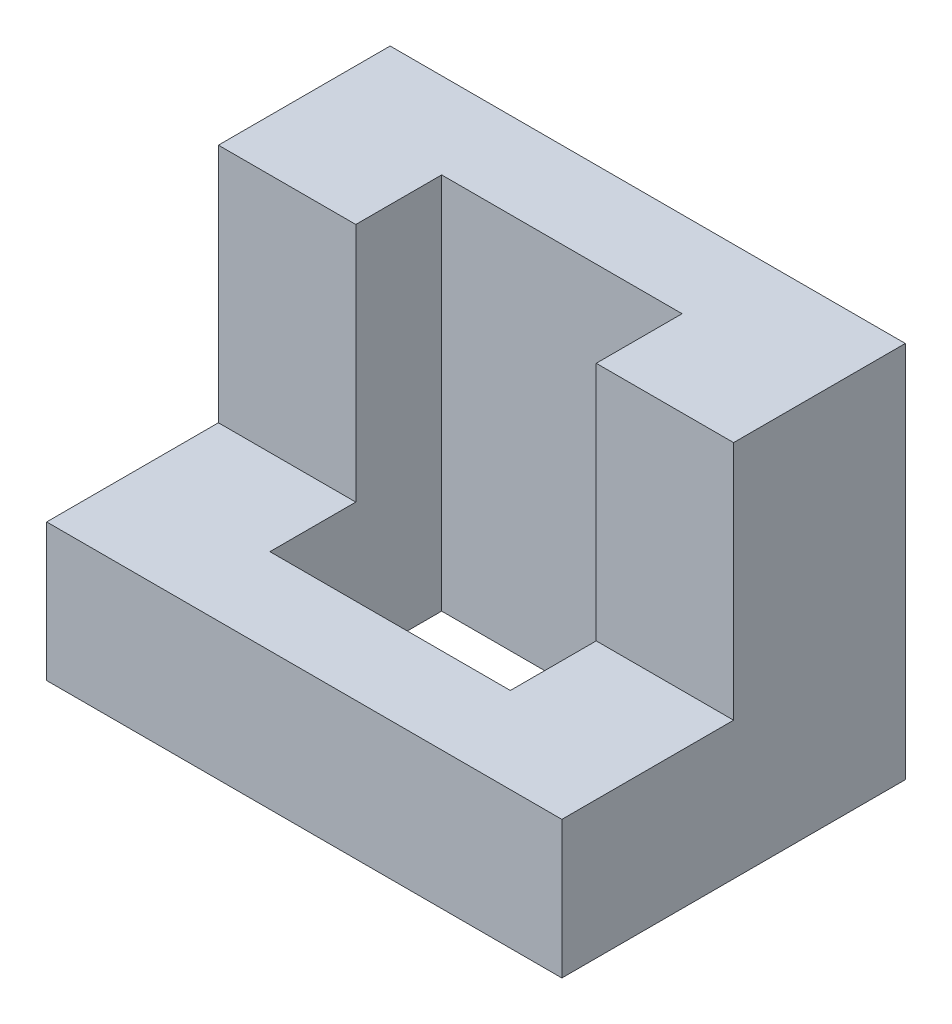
ISO-10303-21;
HEADER;
FILE_DESCRIPTION(('STEP AP214'),'2;1');
FILE_NAME('part.step','',(''),(''),'','','');
FILE_SCHEMA(('AUTOMOTIVE_DESIGN { 1 0 10303 214 1 1 1 1 }'));
ENDSEC;
DATA;
#1=APPLICATION_CONTEXT('core data for automotive mechanical design processes');
#2=APPLICATION_PROTOCOL_DEFINITION('international standard','automotive_design',2000,#1);
#3=PRODUCT_CONTEXT('',#1,'mechanical');
#4=PRODUCT('Part','Part','',(#3));
#5=PRODUCT_RELATED_PRODUCT_CATEGORY('part','',(#4));
#6=PRODUCT_DEFINITION_FORMATION('','',#4);
#7=PRODUCT_DEFINITION_CONTEXT('part definition',#1,'design');
#8=PRODUCT_DEFINITION('design','',#6,#7);
#9=PRODUCT_DEFINITION_SHAPE('','',#8);
#10=(LENGTH_UNIT() NAMED_UNIT(*) SI_UNIT(.MILLI.,.METRE.));
#11=(NAMED_UNIT(*) PLANE_ANGLE_UNIT() SI_UNIT($,.RADIAN.));
#12=(NAMED_UNIT(*) SI_UNIT($,.STERADIAN.) SOLID_ANGLE_UNIT());
#13=UNCERTAINTY_MEASURE_WITH_UNIT(LENGTH_MEASURE(1.E-05),#10,'distance_accuracy_value','');
#14=(GEOMETRIC_REPRESENTATION_CONTEXT(3) GLOBAL_UNCERTAINTY_ASSIGNED_CONTEXT((#13)) GLOBAL_UNIT_ASSIGNED_CONTEXT((#10,
#11,#12)) REPRESENTATION_CONTEXT('',''));
#15=CARTESIAN_POINT('',(0.,0.,0.));
#16=DIRECTION('',(0.,0.,1.));
#17=DIRECTION('',(1.,0.,0.));
#18=AXIS2_PLACEMENT_3D('',#15,#16,#17);
#19=CARTESIAN_POINT('',(0.,8.,-20.));
#20=DIRECTION('',(0.,-1.,0.));
#21=DIRECTION('',(0.,0.,-1.));
#22=AXIS2_PLACEMENT_3D('',#19,#20,#21);
#23=PLANE('',#22);
#24=DIRECTION('',(1.,0.,0.));
#25=VECTOR('',#24,1.);
#26=CARTESIAN_POINT('',(8.,8.,-5.));
#27=LINE('',#26,#25);
#28=CARTESIAN_POINT('',(8.,8.,-5.));
#29=VERTEX_POINT('',#28);
#30=CARTESIAN_POINT('',(22.,8.,-5.));
#31=VERTEX_POINT('',#30);
#32=EDGE_CURVE('E146',#29,#31,#27,.T.);
#33=ORIENTED_EDGE('',*,*,#32,.F.);
#34=DIRECTION('',(0.,0.,1.));
#35=VECTOR('',#34,1.);
#36=CARTESIAN_POINT('',(8.,8.,-15.));
#37=LINE('',#36,#35);
#38=CARTESIAN_POINT('',(8.,8.,-10.));
#39=VERTEX_POINT('',#38);
#40=EDGE_CURVE('E130',#39,#29,#37,.T.);
#41=ORIENTED_EDGE('',*,*,#40,.F.);
#42=DIRECTION('',(1.,0.,0.));
#43=VECTOR('',#42,1.);
#44=CARTESIAN_POINT('',(0.,8.,-10.));
#45=LINE('',#44,#43);
#46=CARTESIAN_POINT('',(0.,8.,-10.));
#47=VERTEX_POINT('',#46);
#48=EDGE_CURVE('E153',#47,#39,#45,.T.);
#49=ORIENTED_EDGE('',*,*,#48,.F.);
#50=DIRECTION('',(0.,0.,1.));
#51=VECTOR('',#50,1.);
#52=CARTESIAN_POINT('',(0.,8.,0.));
#53=LINE('',#52,#51);
#54=CARTESIAN_POINT('',(0.,8.,0.));
#55=VERTEX_POINT('',#54);
#56=EDGE_CURVE('E207',#47,#55,#53,.T.);
#57=ORIENTED_EDGE('',*,*,#56,.T.);
#58=DIRECTION('',(1.,0.,0.));
#59=VECTOR('',#58,1.);
#60=CARTESIAN_POINT('',(0.,8.,0.));
#61=LINE('',#60,#59);
#62=CARTESIAN_POINT('',(30.,8.,0.));
#63=VERTEX_POINT('',#62);
#64=EDGE_CURVE('E204',#55,#63,#61,.T.);
#65=ORIENTED_EDGE('',*,*,#64,.T.);
#66=DIRECTION('',(0.,0.,-1.));
#67=VECTOR('',#66,1.);
#68=CARTESIAN_POINT('',(30.,8.,0.));
#69=LINE('',#68,#67);
#70=CARTESIAN_POINT('',(30.,8.,-10.));
#71=VERTEX_POINT('',#70);
#72=EDGE_CURVE('E211',#63,#71,#69,.T.);
#73=ORIENTED_EDGE('',*,*,#72,.T.);
#74=DIRECTION('',(1.,0.,0.));
#75=VECTOR('',#74,1.);
#76=CARTESIAN_POINT('',(30.,8.,-10.));
#77=LINE('',#76,#75);
#78=CARTESIAN_POINT('',(22.,8.,-10.));
#79=VERTEX_POINT('',#78);
#80=EDGE_CURVE('E159',#79,#71,#77,.T.);
#81=ORIENTED_EDGE('',*,*,#80,.F.);
#82=DIRECTION('',(0.,0.,-1.));
#83=VECTOR('',#82,1.);
#84=CARTESIAN_POINT('',(22.,8.,-15.));
#85=LINE('',#84,#83);
#86=EDGE_CURVE('E54',#31,#79,#85,.T.);
#87=ORIENTED_EDGE('',*,*,#86,.F.);
#88=EDGE_LOOP('',(#33,#41,#49,#57,#65,#73,#81,#87));
#89=FACE_BOUND('',#88,.T.);
#90=ADVANCED_FACE('F31',(#89),#23,.F.);
#91=CARTESIAN_POINT('',(0.,8.,0.));
#92=DIRECTION('',(1.,0.,0.));
#93=DIRECTION('',(0.,0.,-1.));
#94=AXIS2_PLACEMENT_3D('',#91,#92,#93);
#95=PLANE('',#94);
#96=DIRECTION('',(0.,0.,1.));
#97=VECTOR('',#96,1.);
#98=CARTESIAN_POINT('',(0.,0.,0.));
#99=LINE('',#98,#97);
#100=CARTESIAN_POINT('',(0.,0.,-20.));
#101=VERTEX_POINT('',#100);
#102=CARTESIAN_POINT('',(0.,0.,0.));
#103=VERTEX_POINT('',#102);
#104=EDGE_CURVE('E217',#101,#103,#99,.T.);
#105=ORIENTED_EDGE('',*,*,#104,.T.);
#106=DIRECTION('',(0.,-1.,0.));
#107=VECTOR('',#106,1.);
#108=CARTESIAN_POINT('',(0.,8.,0.));
#109=LINE('',#108,#107);
#110=EDGE_CURVE('E11',#55,#103,#109,.T.);
#111=ORIENTED_EDGE('',*,*,#110,.F.);
#112=ORIENTED_EDGE('',*,*,#56,.F.);
#113=DIRECTION('',(0.,-1.,0.));
#114=VECTOR('',#113,1.);
#115=CARTESIAN_POINT('',(0.,22.,-10.));
#116=LINE('',#115,#114);
#117=CARTESIAN_POINT('',(0.,22.,-10.));
#118=VERTEX_POINT('',#117);
#119=EDGE_CURVE('E201',#118,#47,#116,.T.);
#120=ORIENTED_EDGE('',*,*,#119,.F.);
#121=DIRECTION('',(0.,0.,1.));
#122=VECTOR('',#121,1.);
#123=CARTESIAN_POINT('',(0.,22.,-20.));
#124=LINE('',#123,#122);
#125=CARTESIAN_POINT('',(0.,22.,-20.));
#126=VERTEX_POINT('',#125);
#127=EDGE_CURVE('E155',#126,#118,#124,.T.);
#128=ORIENTED_EDGE('',*,*,#127,.F.);
#129=DIRECTION('',(0.,-1.,0.));
#130=VECTOR('',#129,1.);
#131=CARTESIAN_POINT('',(0.,8.,-20.));
#132=LINE('',#131,#130);
#133=EDGE_CURVE('E213',#126,#101,#132,.T.);
#134=ORIENTED_EDGE('',*,*,#133,.T.);
#135=EDGE_LOOP('',(#105,#111,#112,#120,#128,#134));
#136=FACE_BOUND('',#135,.T.);
#137=ADVANCED_FACE('F33',(#136),#95,.F.);
#138=CARTESIAN_POINT('',(0.,8.,0.));
#139=DIRECTION('',(0.,0.,-1.));
#140=DIRECTION('',(-1.,0.,0.));
#141=AXIS2_PLACEMENT_3D('',#138,#139,#140);
#142=PLANE('',#141);
#143=DIRECTION('',(1.,0.,0.));
#144=VECTOR('',#143,1.);
#145=CARTESIAN_POINT('',(0.,0.,0.));
#146=LINE('',#145,#144);
#147=CARTESIAN_POINT('',(30.,0.,0.));
#148=VERTEX_POINT('',#147);
#149=EDGE_CURVE('E220',#103,#148,#146,.T.);
#150=ORIENTED_EDGE('',*,*,#149,.T.);
#151=DIRECTION('',(0.,-1.,0.));
#152=VECTOR('',#151,1.);
#153=CARTESIAN_POINT('',(30.,8.,0.));
#154=LINE('',#153,#152);
#155=EDGE_CURVE('E40',#63,#148,#154,.T.);
#156=ORIENTED_EDGE('',*,*,#155,.F.);
#157=ORIENTED_EDGE('',*,*,#64,.F.);
#158=ORIENTED_EDGE('',*,*,#110,.T.);
#159=EDGE_LOOP('',(#150,#156,#157,#158));
#160=FACE_BOUND('',#159,.T.);
#161=ADVANCED_FACE('F251',(#160),#142,.F.);
#162=CARTESIAN_POINT('',(30.,8.,0.));
#163=DIRECTION('',(-1.,0.,0.));
#164=DIRECTION('',(0.,0.,1.));
#165=AXIS2_PLACEMENT_3D('',#162,#163,#164);
#166=PLANE('',#165);
#167=DIRECTION('',(0.,0.,-1.));
#168=VECTOR('',#167,1.);
#169=CARTESIAN_POINT('',(30.,0.,0.));
#170=LINE('',#169,#168);
#171=CARTESIAN_POINT('',(30.,0.,-20.));
#172=VERTEX_POINT('',#171);
#173=EDGE_CURVE('E222',#148,#172,#170,.T.);
#174=ORIENTED_EDGE('',*,*,#173,.T.);
#175=DIRECTION('',(0.,-1.,0.));
#176=VECTOR('',#175,1.);
#177=CARTESIAN_POINT('',(30.,8.,-20.));
#178=LINE('',#177,#176);
#179=CARTESIAN_POINT('',(30.,22.,-20.));
#180=VERTEX_POINT('',#179);
#181=EDGE_CURVE('E227',#180,#172,#178,.T.);
#182=ORIENTED_EDGE('',*,*,#181,.F.);
#183=DIRECTION('',(0.,0.,-1.));
#184=VECTOR('',#183,1.);
#185=CARTESIAN_POINT('',(30.,22.,-20.));
#186=LINE('',#185,#184);
#187=CARTESIAN_POINT('',(30.,22.,-10.));
#188=VERTEX_POINT('',#187);
#189=EDGE_CURVE('E169',#188,#180,#186,.T.);
#190=ORIENTED_EDGE('',*,*,#189,.F.);
#191=DIRECTION('',(0.,-1.,0.));
#192=VECTOR('',#191,1.);
#193=CARTESIAN_POINT('',(30.,22.,-10.));
#194=LINE('',#193,#192);
#195=EDGE_CURVE('E175',#188,#71,#194,.T.);
#196=ORIENTED_EDGE('',*,*,#195,.T.);
#197=ORIENTED_EDGE('',*,*,#72,.F.);
#198=ORIENTED_EDGE('',*,*,#155,.T.);
#199=EDGE_LOOP('',(#174,#182,#190,#196,#197,#198));
#200=FACE_BOUND('',#199,.T.);
#201=ADVANCED_FACE('F232',(#200),#166,.F.);
#202=CARTESIAN_POINT('',(0.,8.,-20.));
#203=DIRECTION('',(0.,0.,1.));
#204=DIRECTION('',(1.,0.,0.));
#205=AXIS2_PLACEMENT_3D('',#202,#203,#204);
#206=PLANE('',#205);
#207=DIRECTION('',(-1.,0.,0.));
#208=VECTOR('',#207,1.);
#209=CARTESIAN_POINT('',(0.,0.,-20.));
#210=LINE('',#209,#208);
#211=EDGE_CURVE('E209',#172,#101,#210,.T.);
#212=ORIENTED_EDGE('',*,*,#211,.T.);
#213=ORIENTED_EDGE('',*,*,#133,.F.);
#214=DIRECTION('',(-1.,0.,0.));
#215=VECTOR('',#214,1.);
#216=CARTESIAN_POINT('',(0.,22.,-20.));
#217=LINE('',#216,#215);
#218=EDGE_CURVE('E172',#180,#126,#217,.T.);
#219=ORIENTED_EDGE('',*,*,#218,.F.);
#220=ORIENTED_EDGE('',*,*,#181,.T.);
#221=EDGE_LOOP('',(#212,#213,#219,#220));
#222=FACE_BOUND('',#221,.T.);
#223=ADVANCED_FACE('F238',(#222),#206,.F.);
#224=CARTESIAN_POINT('',(0.,0.,-20.));
#225=DIRECTION('',(0.,-1.,0.));
#226=DIRECTION('',(0.,0.,-1.));
#227=AXIS2_PLACEMENT_3D('',#224,#225,#226);
#228=PLANE('',#227);
#229=DIRECTION('',(0.,0.,1.));
#230=VECTOR('',#229,1.);
#231=CARTESIAN_POINT('',(8.,0.,-15.));
#232=LINE('',#231,#230);
#233=CARTESIAN_POINT('',(8.,0.,-15.));
#234=VERTEX_POINT('',#233);
#235=CARTESIAN_POINT('',(8.,0.,-5.));
#236=VERTEX_POINT('',#235);
#237=EDGE_CURVE('E128',#234,#236,#232,.T.);
#238=ORIENTED_EDGE('',*,*,#237,.T.);
#239=DIRECTION('',(1.,0.,0.));
#240=VECTOR('',#239,1.);
#241=CARTESIAN_POINT('',(8.,0.,-5.));
#242=LINE('',#241,#240);
#243=CARTESIAN_POINT('',(22.,0.,-5.));
#244=VERTEX_POINT('',#243);
#245=EDGE_CURVE('E138',#236,#244,#242,.T.);
#246=ORIENTED_EDGE('',*,*,#245,.T.);
#247=DIRECTION('',(0.,0.,-1.));
#248=VECTOR('',#247,1.);
#249=CARTESIAN_POINT('',(22.,0.,-15.));
#250=LINE('',#249,#248);
#251=CARTESIAN_POINT('',(22.,0.,-15.));
#252=VERTEX_POINT('',#251);
#253=EDGE_CURVE('E48',#244,#252,#250,.T.);
#254=ORIENTED_EDGE('',*,*,#253,.T.);
#255=DIRECTION('',(-1.,0.,0.));
#256=VECTOR('',#255,1.);
#257=CARTESIAN_POINT('',(8.,0.,-15.));
#258=LINE('',#257,#256);
#259=EDGE_CURVE('E135',#252,#234,#258,.T.);
#260=ORIENTED_EDGE('',*,*,#259,.T.);
#261=EDGE_LOOP('',(#238,#246,#254,#260));
#262=FACE_BOUND('',#261,.T.);
#263=ORIENTED_EDGE('',*,*,#104,.F.);
#264=ORIENTED_EDGE('',*,*,#211,.F.);
#265=ORIENTED_EDGE('',*,*,#173,.F.);
#266=ORIENTED_EDGE('',*,*,#149,.F.);
#267=EDGE_LOOP('',(#263,#264,#265,#266));
#268=FACE_BOUND('',#267,.T.);
#269=ADVANCED_FACE('F142',(#262,#268),#228,.T.);
#270=CARTESIAN_POINT('',(0.,22.,-10.));
#271=DIRECTION('',(0.,0.,-1.));
#272=DIRECTION('',(-1.,0.,0.));
#273=AXIS2_PLACEMENT_3D('',#270,#271,#272);
#274=PLANE('',#273);
#275=ORIENTED_EDGE('',*,*,#48,.T.);
#276=DIRECTION('',(0.,-1.,0.));
#277=VECTOR('',#276,1.);
#278=CARTESIAN_POINT('',(8.,22.,-10.));
#279=LINE('',#278,#277);
#280=CARTESIAN_POINT('',(8.,22.,-10.));
#281=VERTEX_POINT('',#280);
#282=EDGE_CURVE('E197',#281,#39,#279,.T.);
#283=ORIENTED_EDGE('',*,*,#282,.F.);
#284=DIRECTION('',(1.,0.,0.));
#285=VECTOR('',#284,1.);
#286=CARTESIAN_POINT('',(0.,22.,-10.));
#287=LINE('',#286,#285);
#288=EDGE_CURVE('E158',#118,#281,#287,.T.);
#289=ORIENTED_EDGE('',*,*,#288,.F.);
#290=ORIENTED_EDGE('',*,*,#119,.T.);
#291=EDGE_LOOP('',(#275,#283,#289,#290));
#292=FACE_BOUND('',#291,.T.);
#293=ADVANCED_FACE('F254',(#292),#274,.F.);
#294=CARTESIAN_POINT('',(8.,22.,-15.));
#295=DIRECTION('',(-1.,0.,0.));
#296=DIRECTION('',(0.,0.,1.));
#297=AXIS2_PLACEMENT_3D('',#294,#295,#296);
#298=PLANE('',#297);
#299=ORIENTED_EDGE('',*,*,#282,.T.);
#300=ORIENTED_EDGE('',*,*,#40,.T.);
#301=DIRECTION('',(0.,1.,0.));
#302=VECTOR('',#301,1.);
#303=CARTESIAN_POINT('',(8.,0.,-5.));
#304=LINE('',#303,#302);
#305=EDGE_CURVE('E122',#236,#29,#304,.T.);
#306=ORIENTED_EDGE('',*,*,#305,.F.);
#307=ORIENTED_EDGE('',*,*,#237,.F.);
#308=DIRECTION('',(0.,-1.,0.));
#309=VECTOR('',#308,1.);
#310=CARTESIAN_POINT('',(8.,22.,-15.));
#311=LINE('',#310,#309);
#312=CARTESIAN_POINT('',(8.,22.,-15.));
#313=VERTEX_POINT('',#312);
#314=EDGE_CURVE('E194',#313,#234,#311,.T.);
#315=ORIENTED_EDGE('',*,*,#314,.F.);
#316=DIRECTION('',(0.,0.,-1.));
#317=VECTOR('',#316,1.);
#318=CARTESIAN_POINT('',(8.,22.,-15.));
#319=LINE('',#318,#317);
#320=EDGE_CURVE('E161',#281,#313,#319,.T.);
#321=ORIENTED_EDGE('',*,*,#320,.F.);
#322=EDGE_LOOP('',(#299,#300,#306,#307,#315,#321));
#323=FACE_BOUND('',#322,.T.);
#324=ADVANCED_FACE('F125',(#323),#298,.F.);
#325=CARTESIAN_POINT('',(8.,22.,-15.));
#326=DIRECTION('',(0.,0.,-1.));
#327=DIRECTION('',(-1.,0.,0.));
#328=AXIS2_PLACEMENT_3D('',#325,#326,#327);
#329=PLANE('',#328);
#330=ORIENTED_EDGE('',*,*,#314,.T.);
#331=ORIENTED_EDGE('',*,*,#259,.F.);
#332=DIRECTION('',(0.,-1.,0.));
#333=VECTOR('',#332,1.);
#334=CARTESIAN_POINT('',(22.,22.,-15.));
#335=LINE('',#334,#333);
#336=CARTESIAN_POINT('',(22.,22.,-15.));
#337=VERTEX_POINT('',#336);
#338=EDGE_CURVE('E191',#337,#252,#335,.T.);
#339=ORIENTED_EDGE('',*,*,#338,.F.);
#340=DIRECTION('',(1.,0.,0.));
#341=VECTOR('',#340,1.);
#342=CARTESIAN_POINT('',(8.,22.,-15.));
#343=LINE('',#342,#341);
#344=EDGE_CURVE('E163',#313,#337,#343,.T.);
#345=ORIENTED_EDGE('',*,*,#344,.F.);
#346=EDGE_LOOP('',(#330,#331,#339,#345));
#347=FACE_BOUND('',#346,.T.);
#348=ADVANCED_FACE('F259',(#347),#329,.F.);
#349=CARTESIAN_POINT('',(22.,22.,-15.));
#350=DIRECTION('',(1.,0.,0.));
#351=DIRECTION('',(0.,0.,-1.));
#352=AXIS2_PLACEMENT_3D('',#349,#350,#351);
#353=PLANE('',#352);
#354=ORIENTED_EDGE('',*,*,#338,.T.);
#355=ORIENTED_EDGE('',*,*,#253,.F.);
#356=DIRECTION('',(0.,1.,0.));
#357=VECTOR('',#356,1.);
#358=CARTESIAN_POINT('',(22.,0.,-5.));
#359=LINE('',#358,#357);
#360=EDGE_CURVE('E134',#244,#31,#359,.T.);
#361=ORIENTED_EDGE('',*,*,#360,.T.);
#362=ORIENTED_EDGE('',*,*,#86,.T.);
#363=DIRECTION('',(0.,-1.,0.));
#364=VECTOR('',#363,1.);
#365=CARTESIAN_POINT('',(22.,22.,-10.));
#366=LINE('',#365,#364);
#367=CARTESIAN_POINT('',(22.,22.,-10.));
#368=VERTEX_POINT('',#367);
#369=EDGE_CURVE('E178',#368,#79,#366,.T.);
#370=ORIENTED_EDGE('',*,*,#369,.F.);
#371=DIRECTION('',(0.,0.,1.));
#372=VECTOR('',#371,1.);
#373=CARTESIAN_POINT('',(22.,22.,-15.));
#374=LINE('',#373,#372);
#375=EDGE_CURVE('E165',#337,#368,#374,.T.);
#376=ORIENTED_EDGE('',*,*,#375,.F.);
#377=EDGE_LOOP('',(#354,#355,#361,#362,#370,#376));
#378=FACE_BOUND('',#377,.T.);
#379=ADVANCED_FACE('F260',(#378),#353,.F.);
#380=CARTESIAN_POINT('',(30.,22.,-10.));
#381=DIRECTION('',(0.,0.,-1.));
#382=DIRECTION('',(-1.,0.,0.));
#383=AXIS2_PLACEMENT_3D('',#380,#381,#382);
#384=PLANE('',#383);
#385=ORIENTED_EDGE('',*,*,#80,.T.);
#386=ORIENTED_EDGE('',*,*,#195,.F.);
#387=DIRECTION('',(1.,0.,0.));
#388=VECTOR('',#387,1.);
#389=CARTESIAN_POINT('',(30.,22.,-10.));
#390=LINE('',#389,#388);
#391=EDGE_CURVE('E167',#368,#188,#390,.T.);
#392=ORIENTED_EDGE('',*,*,#391,.F.);
#393=ORIENTED_EDGE('',*,*,#369,.T.);
#394=EDGE_LOOP('',(#385,#386,#392,#393));
#395=FACE_BOUND('',#394,.T.);
#396=ADVANCED_FACE('F249',(#395),#384,.F.);
#397=CARTESIAN_POINT('',(0.,22.,-10.));
#398=DIRECTION('',(0.,1.,0.));
#399=DIRECTION('',(0.,0.,1.));
#400=AXIS2_PLACEMENT_3D('',#397,#398,#399);
#401=PLANE('',#400);
#402=ORIENTED_EDGE('',*,*,#127,.T.);
#403=ORIENTED_EDGE('',*,*,#288,.T.);
#404=ORIENTED_EDGE('',*,*,#320,.T.);
#405=ORIENTED_EDGE('',*,*,#344,.T.);
#406=ORIENTED_EDGE('',*,*,#375,.T.);
#407=ORIENTED_EDGE('',*,*,#391,.T.);
#408=ORIENTED_EDGE('',*,*,#189,.T.);
#409=ORIENTED_EDGE('',*,*,#218,.T.);
#410=EDGE_LOOP('',(#402,#403,#404,#405,#406,#407,#408,#409));
#411=FACE_BOUND('',#410,.T.);
#412=ADVANCED_FACE('F247',(#411),#401,.T.);
#413=CARTESIAN_POINT('',(8.,0.,-5.));
#414=DIRECTION('',(0.,0.,1.));
#415=DIRECTION('',(1.,0.,0.));
#416=AXIS2_PLACEMENT_3D('',#413,#414,#415);
#417=PLANE('',#416);
#418=ORIENTED_EDGE('',*,*,#32,.T.);
#419=ORIENTED_EDGE('',*,*,#360,.F.);
#420=ORIENTED_EDGE('',*,*,#245,.F.);
#421=ORIENTED_EDGE('',*,*,#305,.T.);
#422=EDGE_LOOP('',(#418,#419,#420,#421));
#423=FACE_BOUND('',#422,.T.);
#424=ADVANCED_FACE('F139',(#423),#417,.F.);
#425=CLOSED_SHELL('',(#90,#137,#161,#201,#223,#269,#293,#324,#348,#379,#396,#412,#424));
#426=MANIFOLD_SOLID_BREP('B2',#425);
#427=ADVANCED_BREP_SHAPE_REPRESENTATION('',(#18,#426),#14);
#428=SHAPE_DEFINITION_REPRESENTATION(#9,#427);
ENDSEC;
END-ISO-10303-21;
